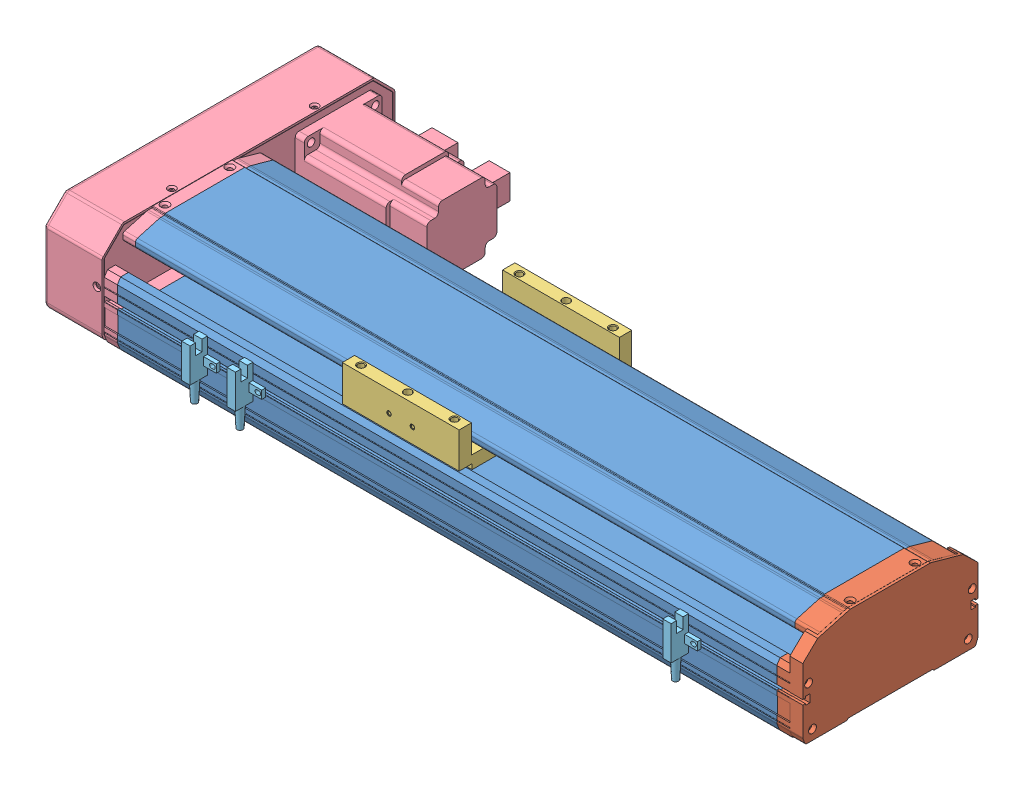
SolidWorks assembly TCD135-P-J4B-0.SLDASM, configuration 350 (file format 9000). Lengths in mm.
Overall size (583.65 78 237.4).
7 component instances, 5 part files, 19 mates.
Components (placement in the parent):
- TCD135-P-J4B-3-1: TCD135-P-J4B-3.SLDPRT [350] at (501.5 1.6 0) x (0 0 1) z (-1 0 0) size (135 73.5 508)
- TCD135-P-J4B-4-1: TCD135-P-J4B-4.SLDPRT [默认] at (372.5 0 0)
- TCD135-P-J4B-1-1: TCD135-P-J4B-1.sldprt [默认] at (210.7653 35.5 0) x (0 0 -1) z (1 0 0)
- TCD135-P-J4B-2-1: TCD135-P-J4B-2.sldprt [默认] at (240 0 0)
- TCD135-P-J4B-5-1: TCD135-P-J4B-5.sldprt [默认] at (203.1996 -3.6004 11) x (0 0 1) z (-1 0 0)
- TCD135-P-J4B-5-2: TCD135-P-J4B-5.sldprt [默认] at (238.1996 -3.6004 11) x (0 0 1) z (-1 0 0)
- TCD135-P-J4B-5-3: TCD135-P-J4B-5.sldprt [默认] at (573.7996 -3.6004 11) x (0 0 1) z (-1 0 0)
Mates (geometry in assembly coordinates):
- 重合26: coincident anti-aligned: plane of TCD135-P-J4B-3-1 through (501.5 1.3082 -63.6472) normal (1 0 0); plane of TCD135-P-J4B-4-1 through (501.5 75.4539 101.0619) normal (-1 0 0)
- 重合27: coincident aligned: plane of TCD135-P-J4B-3-1 through (-6.5 11.6 67) normal (0 0 1); plane of TCD135-P-J4B-4-1 through (372.5 17.6 67) normal (0 0 1)
- 重合28: coincident aligned: plane of TCD135-P-J4B-3-1 through (-6.5 73.5 30.5) normal (0 1 0); plane of TCD135-P-J4B-4-1 through (376.6 73.5 0) normal (0 1 0)
- 距离1: distance = 78 mm anti-aligned: plane of TCD135-P-J4B-1-1 through (210.7653 78 61.75) normal (0 1 0); plane of TCD135-P-J4B-3-1 through (-6.5 0 34.1) normal (0 -1 0)
- 距离2: distance = 0.5 mm aligned: plane of TCD135-P-J4B-1-1 through (210.7653 64.25 -66.5) normal (0 0 -1); plane of TCD135-P-J4B-3-1 through (-6.5 23.6 -67) normal (0 0 -1)
- LimitDistance1: limit distance = 227.2653 mm aligned: plane of TCD135-P-J4B-1-1 through (165.7653 62.25 0) normal (-1 0 0); plane of TCD135-P-J4B-2-1 through (-61.5 37.25 -43.5) normal (-1 0 0)
- LimitDistance2: limit distance = 265.7347 mm aligned: plane of TCD135-P-J4B-4-1 through (521.5 37 0) normal (1 0 0); plane of TCD135-P-J4B-1-1 through (255.7653 62.25 0) normal (1 0 0)
- 重合32: coincident aligned: plane of TCD135-P-J4B-3-1 through (-6.5 73.5 30.5) normal (0 1 0); plane of TCD135-P-J4B-2-1 through (244.1 73.5 0) normal (0 1 0)
- 重合33: coincident aligned: plane of TCD135-P-J4B-3-1 through (-6.5 11.6 67) normal (0 0 1); plane of TCD135-P-J4B-2-1 through (240 17.6 67) normal (0 0 1)
- 重合34: coincident anti-aligned: plane of TCD135-P-J4B-3-1 through (-6.5 1.3082 -63.6472) normal (-1 0 0); plane of TCD135-P-J4B-2-1 through (-6.5 282.5 -74.6434) normal (1 0 0)
- 重合35: coincident anti-aligned: plane of TCD135-P-J4B-3-1 through (-6.5 24.1 67.5) normal (0 0 1); plane of TCD135-P-J4B-5-1 through (46.7 18.6 67.5) normal (0 0 -1)
- 重合36: coincident aligned: plane of TCD135-P-J4B-3-1 through (-6.5 27.8 67.2) normal (0 1 0); plane of TCD135-P-J4B-5-1 through (50.1633 27.8 67.5) normal (0 1 0)
- 重合37: coincident anti-aligned: plane of TCD135-P-J4B-3-1 through (-6.5 24.1 67.5) normal (0 0 1); plane of TCD135-P-J4B-5-2 through (81.7 18.6 67.5) normal (0 0 -1)
- 重合38: coincident aligned: plane of TCD135-P-J4B-3-1 through (-6.5 27.8 67.2) normal (0 1 0); plane of TCD135-P-J4B-5-2 through (85.1633 27.8 67.5) normal (0 1 0)
- 重合39: coincident anti-aligned: plane of TCD135-P-J4B-3-1 through (-6.5 24.1 67.5) normal (0 0 1); plane of TCD135-P-J4B-5-3 through (417.3 18.6 67.5) normal (0 0 -1)
- 重合40: coincident aligned: plane of TCD135-P-J4B-3-1 through (-6.5 27.8 67.2) normal (0 1 0); plane of TCD135-P-J4B-5-3 through (420.7633 27.8 67.5) normal (0 1 0)
- 距离3: distance = 35 mm aligned: plane of TCD135-P-J4B-5-2 through (91.5 18.6 67.5) normal (-1 0 0); plane of TCD135-P-J4B-5-1 through (56.5 18.6 67.5) normal (-1 0 0)
- 距离4: distance = 118 mm aligned: plane of TCD135-P-J4B-5-1 through (56.5 18.6 67.5) normal (-1 0 0); plane of TCD135-P-J4B-2-1 through (-61.5 37.25 -43.5) normal (-1 0 0)
- 距离5: distance = 88 mm aligned: plane of TCD135-P-J4B-5-3 through (433.5 18.6 67.5) normal (1 0 0); plane of TCD135-P-J4B-4-1 through (521.5 37 0) normal (1 0 0)
